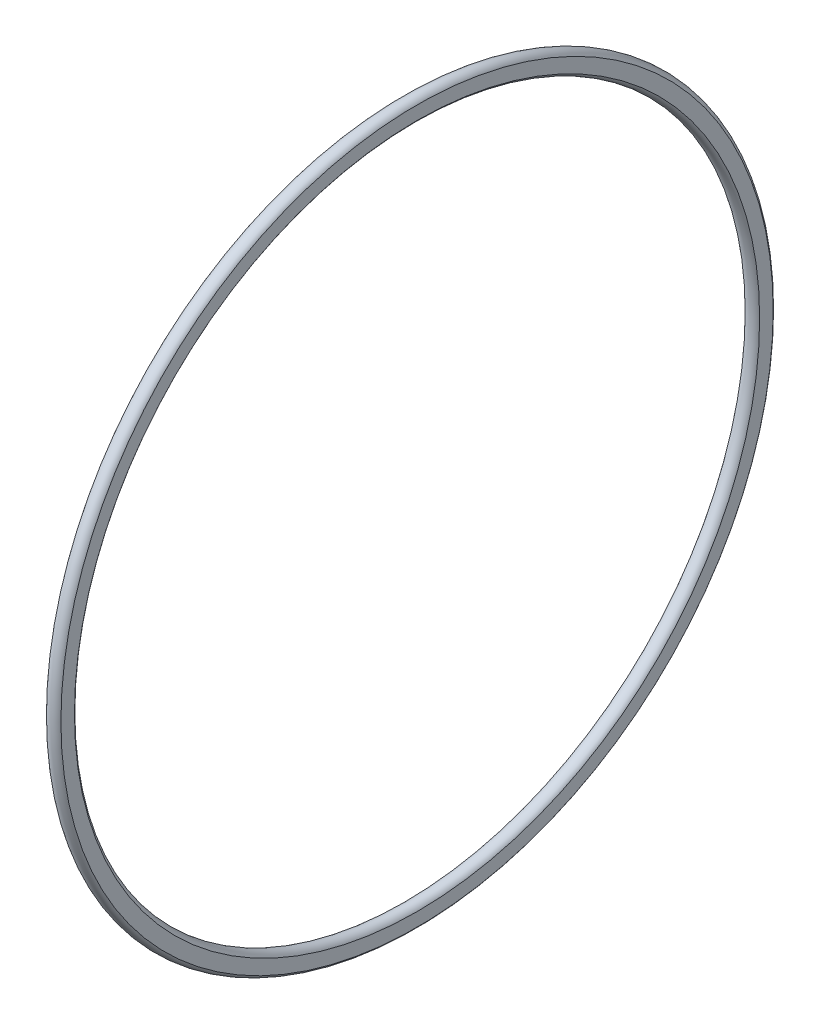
ISO-10303-21;
HEADER;
FILE_DESCRIPTION(('STEP AP214'),'2;1');
FILE_NAME('part.step','',(''),(''),'','','');
FILE_SCHEMA(('AUTOMOTIVE_DESIGN { 1 0 10303 214 1 1 1 1 }'));
ENDSEC;
DATA;
#1=APPLICATION_CONTEXT('core data for automotive mechanical design processes');
#2=APPLICATION_PROTOCOL_DEFINITION('international standard','automotive_design',2000,#1);
#3=PRODUCT_CONTEXT('',#1,'mechanical');
#4=PRODUCT('Part','Part','',(#3));
#5=PRODUCT_RELATED_PRODUCT_CATEGORY('part','',(#4));
#6=PRODUCT_DEFINITION_FORMATION('','',#4);
#7=PRODUCT_DEFINITION_CONTEXT('part definition',#1,'design');
#8=PRODUCT_DEFINITION('design','',#6,#7);
#9=PRODUCT_DEFINITION_SHAPE('','',#8);
#10=(LENGTH_UNIT() NAMED_UNIT(*) SI_UNIT(.MILLI.,.METRE.));
#11=(NAMED_UNIT(*) PLANE_ANGLE_UNIT() SI_UNIT($,.RADIAN.));
#12=(NAMED_UNIT(*) SI_UNIT($,.STERADIAN.) SOLID_ANGLE_UNIT());
#13=UNCERTAINTY_MEASURE_WITH_UNIT(LENGTH_MEASURE(1.E-05),#10,'distance_accuracy_value','');
#14=(GEOMETRIC_REPRESENTATION_CONTEXT(3) GLOBAL_UNCERTAINTY_ASSIGNED_CONTEXT((#13)) GLOBAL_UNIT_ASSIGNED_CONTEXT((#10,
#11,#12)) REPRESENTATION_CONTEXT('',''));
#15=CARTESIAN_POINT('',(0.,0.,0.));
#16=DIRECTION('',(0.,0.,1.));
#17=DIRECTION('',(1.,0.,0.));
#18=AXIS2_PLACEMENT_3D('',#15,#16,#17);
#19=CARTESIAN_POINT('',(-0.990599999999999,0.,0.));
#20=DIRECTION('',(1.,0.,0.));
#21=DIRECTION('',(0.,0.,-1.));
#22=AXIS2_PLACEMENT_3D('',#19,#20,#21);
#23=TOROIDAL_SURFACE('',#22,48.7299,1.143);
#24=CARTESIAN_POINT('',(0.,0.,0.));
#25=DIRECTION('',(1.,0.,0.));
#26=DIRECTION('',(0.,0.,-1.));
#27=AXIS2_PLACEMENT_3D('',#24,#25,#26);
#28=CIRCLE('',#27,48.1596714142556);
#29=CARTESIAN_POINT('',(0.,0.,-48.1596714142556));
#30=VERTEX_POINT('',#29);
#31=EDGE_CURVE('E10',#30,#30,#28,.T.);
#32=ORIENTED_EDGE('',*,*,#31,.T.);
#33=EDGE_LOOP('',(#32));
#34=FACE_BOUND('',#33,.T.);
#35=CARTESIAN_POINT('',(-1.9812,0.,0.));
#36=DIRECTION('',(1.,0.,0.));
#37=DIRECTION('',(0.,0.,-1.));
#38=AXIS2_PLACEMENT_3D('',#35,#36,#37);
#39=CIRCLE('',#38,48.1596714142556);
#40=CARTESIAN_POINT('',(-1.9812,0.,-48.1596714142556));
#41=VERTEX_POINT('',#40);
#42=EDGE_CURVE('E393',#41,#41,#39,.T.);
#43=ORIENTED_EDGE('',*,*,#42,.F.);
#44=EDGE_LOOP('',(#43));
#45=FACE_BOUND('',#44,.T.);
#46=ADVANCED_FACE('F379',(#34,#45),#23,.T.);
#47=CARTESIAN_POINT('',(0.,48.1596714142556,0.));
#48=DIRECTION('',(1.,0.,0.));
#49=DIRECTION('',(0.,0.,-1.));
#50=AXIS2_PLACEMENT_3D('',#47,#48,#49);
#51=PLANE('',#50);
#52=CARTESIAN_POINT('',(0.,0.,0.));
#53=DIRECTION('',(1.,0.,0.));
#54=DIRECTION('',(0.,0.,-1.));
#55=AXIS2_PLACEMENT_3D('',#52,#53,#54);
#56=CIRCLE('',#55,50.0621285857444);
#57=CARTESIAN_POINT('',(0.,0.,-50.0621285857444));
#58=VERTEX_POINT('',#57);
#59=EDGE_CURVE('E385',#58,#58,#56,.T.);
#60=ORIENTED_EDGE('',*,*,#59,.T.);
#61=EDGE_LOOP('',(#60));
#62=FACE_BOUND('',#61,.T.);
#63=ORIENTED_EDGE('',*,*,#31,.F.);
#64=EDGE_LOOP('',(#63));
#65=FACE_BOUND('',#64,.T.);
#66=ADVANCED_FACE('F403',(#62,#65),#51,.T.);
#67=CARTESIAN_POINT('',(-0.990599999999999,0.,0.));
#68=DIRECTION('',(1.,0.,0.));
#69=DIRECTION('',(0.,0.,-1.));
#70=AXIS2_PLACEMENT_3D('',#67,#68,#69);
#71=TOROIDAL_SURFACE('',#70,49.4919,1.14300000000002);
#72=CARTESIAN_POINT('',(-1.9812,0.,0.));
#73=DIRECTION('',(1.,0.,0.));
#74=DIRECTION('',(0.,0.,-1.));
#75=AXIS2_PLACEMENT_3D('',#72,#73,#74);
#76=CIRCLE('',#75,50.0621285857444);
#77=CARTESIAN_POINT('',(-1.9812,0.,-50.0621285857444));
#78=VERTEX_POINT('',#77);
#79=EDGE_CURVE('E389',#78,#78,#76,.T.);
#80=ORIENTED_EDGE('',*,*,#79,.T.);
#81=EDGE_LOOP('',(#80));
#82=FACE_BOUND('',#81,.T.);
#83=ORIENTED_EDGE('',*,*,#59,.F.);
#84=EDGE_LOOP('',(#83));
#85=FACE_BOUND('',#84,.T.);
#86=ADVANCED_FACE('F407',(#82,#85),#71,.T.);
#87=CARTESIAN_POINT('',(-1.9812,50.0621285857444,0.));
#88=DIRECTION('',(-1.,0.,0.));
#89=DIRECTION('',(0.,0.,1.));
#90=AXIS2_PLACEMENT_3D('',#87,#88,#89);
#91=PLANE('',#90);
#92=ORIENTED_EDGE('',*,*,#42,.T.);
#93=EDGE_LOOP('',(#92));
#94=FACE_BOUND('',#93,.T.);
#95=ORIENTED_EDGE('',*,*,#79,.F.);
#96=EDGE_LOOP('',(#95));
#97=FACE_BOUND('',#96,.T.);
#98=ADVANCED_FACE('F399',(#94,#97),#91,.T.);
#99=CLOSED_SHELL('',(#46,#66,#86,#98));
#100=MANIFOLD_SOLID_BREP('B2',#99);
#101=ADVANCED_BREP_SHAPE_REPRESENTATION('',(#18,#100),#14);
#102=SHAPE_DEFINITION_REPRESENTATION(#9,#101);
ENDSEC;
END-ISO-10303-21;
